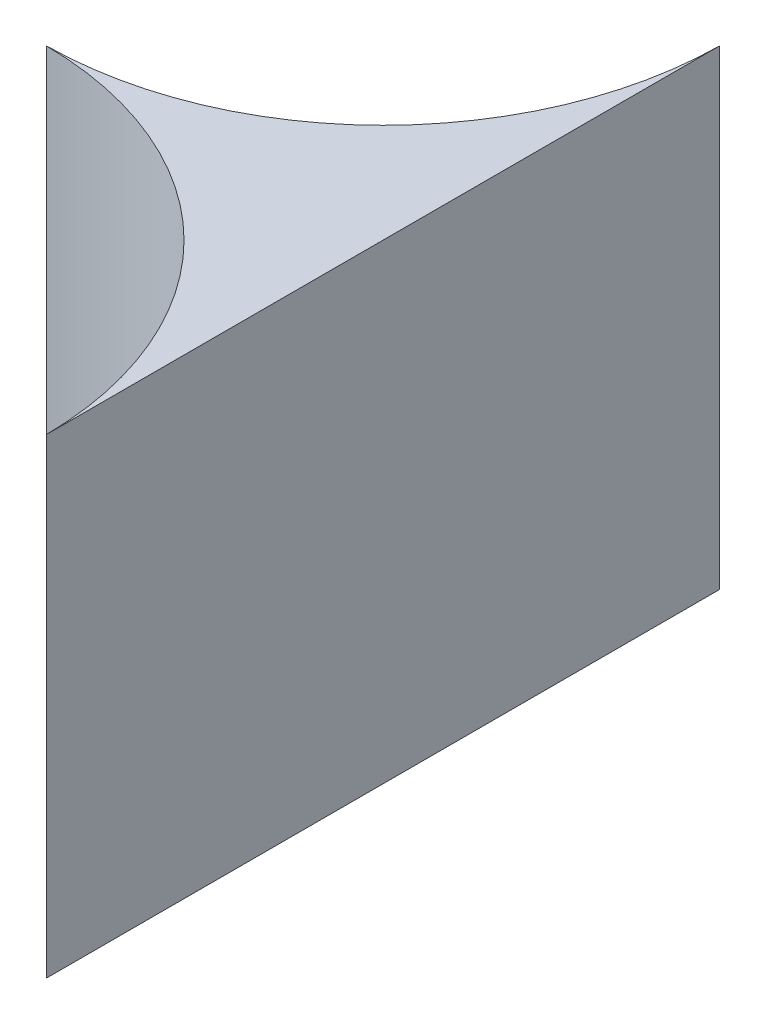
ISO-10303-21;
HEADER;
FILE_DESCRIPTION(('STEP AP214'),'2;1');
FILE_NAME('part.step','',(''),(''),'','','');
FILE_SCHEMA(('AUTOMOTIVE_DESIGN { 1 0 10303 214 1 1 1 1 }'));
ENDSEC;
DATA;
#1=APPLICATION_CONTEXT('core data for automotive mechanical design processes');
#2=APPLICATION_PROTOCOL_DEFINITION('international standard','automotive_design',2000,#1);
#3=PRODUCT_CONTEXT('',#1,'mechanical');
#4=PRODUCT('Part','Part','',(#3));
#5=PRODUCT_RELATED_PRODUCT_CATEGORY('part','',(#4));
#6=PRODUCT_DEFINITION_FORMATION('','',#4);
#7=PRODUCT_DEFINITION_CONTEXT('part definition',#1,'design');
#8=PRODUCT_DEFINITION('design','',#6,#7);
#9=PRODUCT_DEFINITION_SHAPE('','',#8);
#10=(LENGTH_UNIT() NAMED_UNIT(*) SI_UNIT(.MILLI.,.METRE.));
#11=(NAMED_UNIT(*) PLANE_ANGLE_UNIT() SI_UNIT($,.RADIAN.));
#12=(NAMED_UNIT(*) SI_UNIT($,.STERADIAN.) SOLID_ANGLE_UNIT());
#13=UNCERTAINTY_MEASURE_WITH_UNIT(LENGTH_MEASURE(1.E-05),#10,'distance_accuracy_value','');
#14=(GEOMETRIC_REPRESENTATION_CONTEXT(3) GLOBAL_UNCERTAINTY_ASSIGNED_CONTEXT((#13)) GLOBAL_UNIT_ASSIGNED_CONTEXT((#10,
#11,#12)) REPRESENTATION_CONTEXT('',''));
#15=CARTESIAN_POINT('',(0.,0.,0.));
#16=DIRECTION('',(0.,0.,1.));
#17=DIRECTION('',(1.,0.,0.));
#18=AXIS2_PLACEMENT_3D('',#15,#16,#17);
#19=CARTESIAN_POINT('',(-23.2891305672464,33.25,22.725));
#20=DIRECTION('',(0.,-1.,0.));
#21=DIRECTION('',(0.,0.,-1.));
#22=AXIS2_PLACEMENT_3D('',#19,#20,#21);
#23=CYLINDRICAL_SURFACE('',#22,22.725);
#24=CARTESIAN_POINT('',(-23.2891305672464,1.75,22.725));
#25=DIRECTION('',(0.,1.,0.));
#26=DIRECTION('',(0.,0.,1.));
#27=AXIS2_PLACEMENT_3D('',#24,#25,#26);
#28=CIRCLE('',#27,22.725);
#29=CARTESIAN_POINT('',(-0.565244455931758,1.75,22.5));
#30=VERTEX_POINT('',#29);
#31=CARTESIAN_POINT('',(-23.0641305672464,1.75,0.00111388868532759));
#32=VERTEX_POINT('',#31);
#33=EDGE_CURVE('E75',#30,#32,#28,.T.);
#34=ORIENTED_EDGE('',*,*,#33,.F.);
#35=DIRECTION('',(0.,-1.,0.));
#36=VECTOR('',#35,1.);
#37=CARTESIAN_POINT('',(-0.565244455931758,33.25,22.5));
#38=LINE('',#37,#36);
#39=CARTESIAN_POINT('',(-0.565244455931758,33.25,22.5));
#40=VERTEX_POINT('',#39);
#41=EDGE_CURVE('E11',#40,#30,#38,.T.);
#42=ORIENTED_EDGE('',*,*,#41,.F.);
#43=CARTESIAN_POINT('',(-23.2891305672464,33.25,22.725));
#44=DIRECTION('',(0.,1.,0.));
#45=DIRECTION('',(0.,0.,1.));
#46=AXIS2_PLACEMENT_3D('',#43,#44,#45);
#47=CIRCLE('',#46,22.725);
#48=CARTESIAN_POINT('',(-23.0641305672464,33.25,0.00111388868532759));
#49=VERTEX_POINT('',#48);
#50=EDGE_CURVE('E77',#40,#49,#47,.T.);
#51=ORIENTED_EDGE('',*,*,#50,.T.);
#52=DIRECTION('',(0.,-1.,0.));
#53=VECTOR('',#52,1.);
#54=CARTESIAN_POINT('',(-23.0641305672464,33.25,0.00111388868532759));
#55=LINE('',#54,#53);
#56=EDGE_CURVE('E59',#49,#32,#55,.T.);
#57=ORIENTED_EDGE('',*,*,#56,.T.);
#58=EDGE_LOOP('',(#34,#42,#51,#57));
#59=FACE_BOUND('',#58,.T.);
#60=ADVANCED_FACE('F42',(#59),#23,.F.);
#61=CARTESIAN_POINT('',(-23.2891305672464,33.25,-22.725));
#62=DIRECTION('',(0.,-1.,0.));
#63=DIRECTION('',(0.,0.,-1.));
#64=AXIS2_PLACEMENT_3D('',#61,#62,#63);
#65=CYLINDRICAL_SURFACE('',#64,22.725);
#66=CARTESIAN_POINT('',(-23.2891305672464,1.75,-22.725));
#67=DIRECTION('',(0.,1.,0.));
#68=DIRECTION('',(0.,0.,1.));
#69=AXIS2_PLACEMENT_3D('',#66,#67,#68);
#70=CIRCLE('',#69,22.725);
#71=CARTESIAN_POINT('',(-23.0641305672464,1.75,-0.00111388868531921));
#72=VERTEX_POINT('',#71);
#73=CARTESIAN_POINT('',(-0.565244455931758,1.75,-22.5));
#74=VERTEX_POINT('',#73);
#75=EDGE_CURVE('E91',#72,#74,#70,.T.);
#76=ORIENTED_EDGE('',*,*,#75,.F.);
#77=DIRECTION('',(0.,-1.,0.));
#78=VECTOR('',#77,1.);
#79=CARTESIAN_POINT('',(-23.0641305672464,33.25,-0.00111388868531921));
#80=LINE('',#79,#78);
#81=CARTESIAN_POINT('',(-23.0641305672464,33.25,-0.00111388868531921));
#82=VERTEX_POINT('',#81);
#83=EDGE_CURVE('E69',#82,#72,#80,.T.);
#84=ORIENTED_EDGE('',*,*,#83,.F.);
#85=CARTESIAN_POINT('',(-23.2891305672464,33.25,-22.725));
#86=DIRECTION('',(0.,1.,0.));
#87=DIRECTION('',(0.,0.,1.));
#88=AXIS2_PLACEMENT_3D('',#85,#86,#87);
#89=CIRCLE('',#88,22.725);
#90=CARTESIAN_POINT('',(-0.565244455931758,33.25,-22.5));
#91=VERTEX_POINT('',#90);
#92=EDGE_CURVE('E99',#82,#91,#89,.T.);
#93=ORIENTED_EDGE('',*,*,#92,.T.);
#94=DIRECTION('',(0.,-1.,0.));
#95=VECTOR('',#94,1.);
#96=CARTESIAN_POINT('',(-0.565244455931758,33.25,-22.5));
#97=LINE('',#96,#95);
#98=EDGE_CURVE('E51',#91,#74,#97,.T.);
#99=ORIENTED_EDGE('',*,*,#98,.T.);
#100=EDGE_LOOP('',(#76,#84,#93,#99));
#101=FACE_BOUND('',#100,.T.);
#102=ADVANCED_FACE('F110',(#101),#65,.F.);
#103=CARTESIAN_POINT('',(-23.0641305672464,33.25,0.));
#104=DIRECTION('',(-1.,0.,0.));
#105=DIRECTION('',(0.,0.,1.));
#106=AXIS2_PLACEMENT_3D('',#103,#104,#105);
#107=PLANE('',#106);
#108=DIRECTION('',(0.,0.,-1.));
#109=VECTOR('',#108,1.);
#110=CARTESIAN_POINT('',(-23.0641305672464,1.75,0.));
#111=LINE('',#110,#109);
#112=EDGE_CURVE('E87',#32,#72,#111,.T.);
#113=ORIENTED_EDGE('',*,*,#112,.F.);
#114=ORIENTED_EDGE('',*,*,#56,.F.);
#115=DIRECTION('',(0.,0.,-1.));
#116=VECTOR('',#115,1.);
#117=CARTESIAN_POINT('',(-23.0641305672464,33.25,0.));
#118=LINE('',#117,#116);
#119=EDGE_CURVE('E80',#49,#82,#118,.T.);
#120=ORIENTED_EDGE('',*,*,#119,.T.);
#121=ORIENTED_EDGE('',*,*,#83,.T.);
#122=EDGE_LOOP('',(#113,#114,#120,#121));
#123=FACE_BOUND('',#122,.T.);
#124=ADVANCED_FACE('F94',(#123),#107,.T.);
#125=CARTESIAN_POINT('',(-0.564130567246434,33.25,0.));
#126=DIRECTION('',(0.,1.,0.));
#127=DIRECTION('',(0.,0.,1.));
#128=AXIS2_PLACEMENT_3D('',#125,#126,#127);
#129=PLANE('',#128);
#130=DIRECTION('',(0.,0.,-1.));
#131=VECTOR('',#130,1.);
#132=CARTESIAN_POINT('',(-0.565244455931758,33.25,22.5));
#133=LINE('',#132,#131);
#134=EDGE_CURVE('E92',#40,#91,#133,.T.);
#135=ORIENTED_EDGE('',*,*,#134,.T.);
#136=ORIENTED_EDGE('',*,*,#92,.F.);
#137=ORIENTED_EDGE('',*,*,#119,.F.);
#138=ORIENTED_EDGE('',*,*,#50,.F.);
#139=EDGE_LOOP('',(#135,#136,#137,#138));
#140=FACE_BOUND('',#139,.T.);
#141=ADVANCED_FACE('F119',(#140),#129,.T.);
#142=CARTESIAN_POINT('',(-0.564130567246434,1.75,0.));
#143=DIRECTION('',(0.,1.,0.));
#144=DIRECTION('',(0.,0.,1.));
#145=AXIS2_PLACEMENT_3D('',#142,#143,#144);
#146=PLANE('',#145);
#147=ORIENTED_EDGE('',*,*,#75,.T.);
#148=DIRECTION('',(0.,0.,-1.));
#149=VECTOR('',#148,1.);
#150=CARTESIAN_POINT('',(-0.565244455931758,1.75,22.5));
#151=LINE('',#150,#149);
#152=EDGE_CURVE('E89',#30,#74,#151,.T.);
#153=ORIENTED_EDGE('',*,*,#152,.F.);
#154=ORIENTED_EDGE('',*,*,#33,.T.);
#155=ORIENTED_EDGE('',*,*,#112,.T.);
#156=EDGE_LOOP('',(#147,#153,#154,#155));
#157=FACE_BOUND('',#156,.T.);
#158=ADVANCED_FACE('F86',(#157),#146,.F.);
#159=CARTESIAN_POINT('',(-0.565244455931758,33.25,22.5));
#160=DIRECTION('',(-1.,0.,0.));
#161=DIRECTION('',(0.,0.,1.));
#162=AXIS2_PLACEMENT_3D('',#159,#160,#161);
#163=PLANE('',#162);
#164=ORIENTED_EDGE('',*,*,#98,.F.);
#165=ORIENTED_EDGE('',*,*,#134,.F.);
#166=ORIENTED_EDGE('',*,*,#41,.T.);
#167=ORIENTED_EDGE('',*,*,#152,.T.);
#168=EDGE_LOOP('',(#164,#165,#166,#167));
#169=FACE_BOUND('',#168,.T.);
#170=ADVANCED_FACE('F117',(#169),#163,.F.);
#171=CLOSED_SHELL('',(#60,#102,#124,#141,#158,#170));
#172=MANIFOLD_SOLID_BREP('B2',#171);
#173=ADVANCED_BREP_SHAPE_REPRESENTATION('',(#18,#172),#14);
#174=SHAPE_DEFINITION_REPRESENTATION(#9,#173);
ENDSEC;
END-ISO-10303-21;
